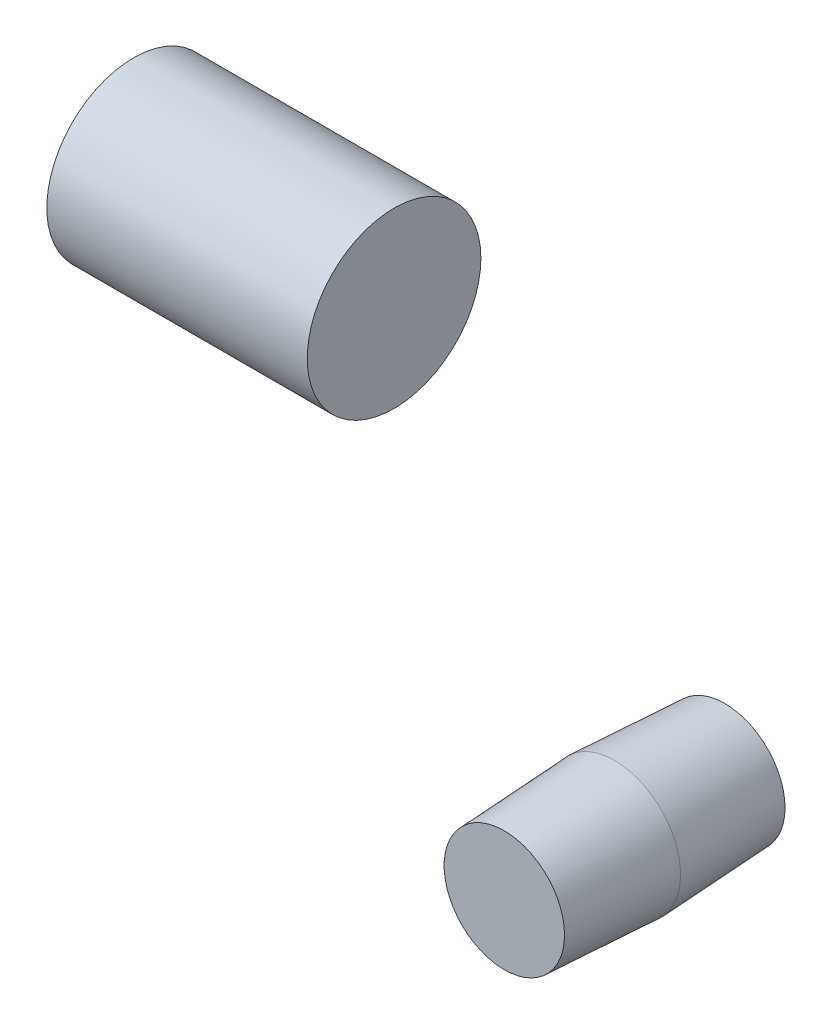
from build123d import *

# Parameters (mm, degrees)
SKETCH1_R                     = 19
BOSS_EXTRUDE1_DEPTH           = 31.75
BOSS_EXTRUDE1_TAPER           = 3
BOSS_EXTRUDE1_OTHER_WAY_DEPTH = 31.75
BOSS_EXTRUDE1_OTHER_WAY_TAPER = 3
BOSS_EXTRUDE2_START           = -63.5
SKETCH2_R                     = 25
BOSS_EXTRUDE2_DEPTH           = 75


with BuildPart() as part:
    # Sketch1 → Boss-Extrude1 (new body)
    with BuildSketch(Plane.XY):
        Circle(SKETCH1_R)
    extrude(amount=BOSS_EXTRUDE1_DEPTH, taper=BOSS_EXTRUDE1_TAPER)

    # Sketch1 → Boss-Extrude1 other way (add)
    with BuildSketch(Plane.XY):
        Circle(SKETCH1_R)
    extrude(amount=-BOSS_EXTRUDE1_OTHER_WAY_DEPTH, taper=BOSS_EXTRUDE1_OTHER_WAY_TAPER)


with BuildPart() as body_2:
    # Sketch2 → Boss-Extrude2 (new body)
    with BuildSketch(Plane(origin=(0, 0, 0), x_dir=(0, 0, -1), z_dir=(1, 0, 0)).offset(BOSS_EXTRUDE2_START)):
        with Locations((0, 100)):
            Circle(SKETCH2_R)
    extrude(amount=-BOSS_EXTRUDE2_DEPTH)


solid = Compound([part.part, body_2.part])
